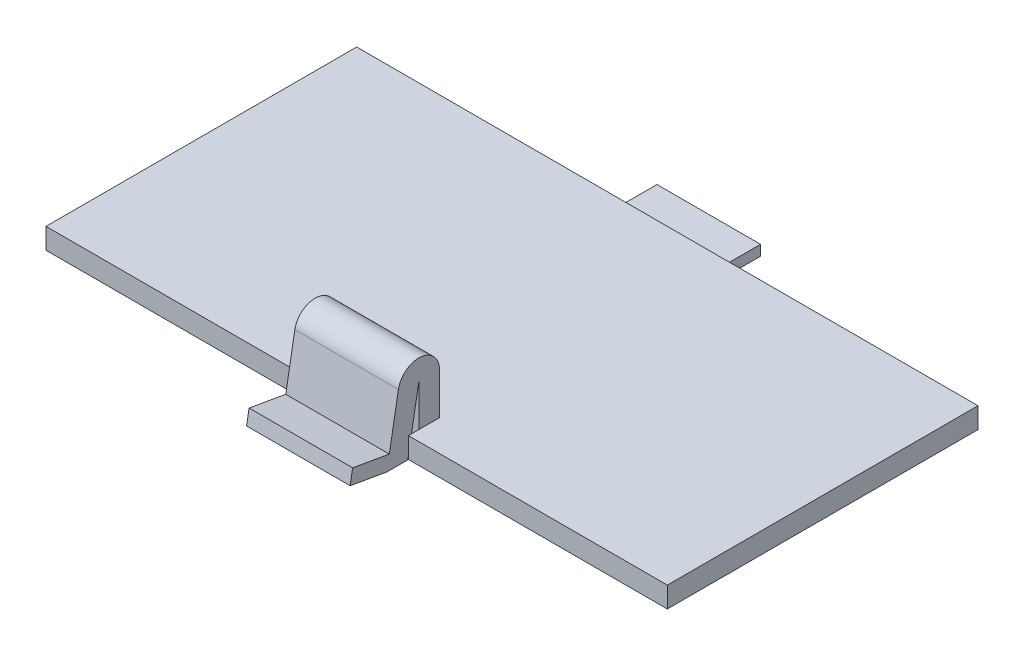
ISO-10303-21;
HEADER;
FILE_DESCRIPTION(('STEP AP214'),'2;1');
FILE_NAME('part.step','',(''),(''),'','','');
FILE_SCHEMA(('AUTOMOTIVE_DESIGN { 1 0 10303 214 1 1 1 1 }'));
ENDSEC;
DATA;
#1=APPLICATION_CONTEXT('core data for automotive mechanical design processes');
#2=APPLICATION_PROTOCOL_DEFINITION('international standard','automotive_design',2000,#1);
#3=PRODUCT_CONTEXT('',#1,'mechanical');
#4=PRODUCT('Part','Part','',(#3));
#5=PRODUCT_RELATED_PRODUCT_CATEGORY('part','',(#4));
#6=PRODUCT_DEFINITION_FORMATION('','',#4);
#7=PRODUCT_DEFINITION_CONTEXT('part definition',#1,'design');
#8=PRODUCT_DEFINITION('design','',#6,#7);
#9=PRODUCT_DEFINITION_SHAPE('','',#8);
#10=(LENGTH_UNIT() NAMED_UNIT(*) SI_UNIT(.MILLI.,.METRE.));
#11=(NAMED_UNIT(*) PLANE_ANGLE_UNIT() SI_UNIT($,.RADIAN.));
#12=(NAMED_UNIT(*) SI_UNIT($,.STERADIAN.) SOLID_ANGLE_UNIT());
#13=UNCERTAINTY_MEASURE_WITH_UNIT(LENGTH_MEASURE(1.E-05),#10,'distance_accuracy_value','');
#14=(GEOMETRIC_REPRESENTATION_CONTEXT(3) GLOBAL_UNCERTAINTY_ASSIGNED_CONTEXT((#13)) GLOBAL_UNIT_ASSIGNED_CONTEXT((#10,
#11,#12)) REPRESENTATION_CONTEXT('',''));
#15=CARTESIAN_POINT('',(0.,0.,0.));
#16=DIRECTION('',(0.,0.,1.));
#17=DIRECTION('',(1.,0.,0.));
#18=AXIS2_PLACEMENT_3D('',#15,#16,#17);
#19=CARTESIAN_POINT('',(-125.255102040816,-1.,63.7857142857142));
#20=DIRECTION('',(-1.,0.,0.));
#21=DIRECTION('',(0.,0.,1.));
#22=AXIS2_PLACEMENT_3D('',#19,#20,#21);
#23=PLANE('',#22);
#24=DIRECTION('',(0.,0.984807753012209,-0.173648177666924));
#25=VECTOR('',#24,1.);
#26=CARTESIAN_POINT('',(-125.255102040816,-0.939231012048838,64.4803069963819));
#27=LINE('',#26,#25);
#28=CARTESIAN_POINT('',(-125.255102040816,0.164359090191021,64.2857142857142));
#29=VERTEX_POINT('',#28);
#30=CARTESIAN_POINT('',(-125.255102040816,1.,64.1383682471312));
#31=VERTEX_POINT('',#30);
#32=EDGE_CURVE('E241',#29,#31,#27,.T.);
#33=ORIENTED_EDGE('',*,*,#32,.F.);
#34=DIRECTION('',(0.,1.,0.));
#35=VECTOR('',#34,1.);
#36=CARTESIAN_POINT('',(-125.255102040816,-1.,64.2857142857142));
#37=LINE('',#36,#35);
#38=CARTESIAN_POINT('',(-125.255102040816,0.,64.2857142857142));
#39=VERTEX_POINT('',#38);
#40=EDGE_CURVE('E249',#39,#29,#37,.T.);
#41=ORIENTED_EDGE('',*,*,#40,.F.);
#42=DIRECTION('',(0.,0.,1.));
#43=VECTOR('',#42,1.);
#44=CARTESIAN_POINT('',(-125.255102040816,0.,0.));
#45=LINE('',#44,#43);
#46=CARTESIAN_POINT('',(-125.255102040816,0.,63.7857142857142));
#47=VERTEX_POINT('',#46);
#48=EDGE_CURVE('E361',#47,#39,#45,.T.);
#49=ORIENTED_EDGE('',*,*,#48,.F.);
#50=DIRECTION('',(0.,1.,0.));
#51=VECTOR('',#50,1.);
#52=CARTESIAN_POINT('',(-125.255102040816,-1.,63.7857142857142));
#53=LINE('',#52,#51);
#54=CARTESIAN_POINT('',(-125.255102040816,1.,63.7857142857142));
#55=VERTEX_POINT('',#54);
#56=EDGE_CURVE('E254',#47,#55,#53,.T.);
#57=ORIENTED_EDGE('',*,*,#56,.T.);
#58=DIRECTION('',(0.,0.,1.));
#59=VECTOR('',#58,1.);
#60=CARTESIAN_POINT('',(-125.255102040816,1.,63.7857142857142));
#61=LINE('',#60,#59);
#62=EDGE_CURVE('E246',#55,#31,#61,.T.);
#63=ORIENTED_EDGE('',*,*,#62,.T.);
#64=EDGE_LOOP('',(#33,#41,#49,#57,#63));
#65=FACE_BOUND('',#64,.T.);
#66=ADVANCED_FACE('F35',(#65),#23,.F.);
#67=CARTESIAN_POINT('',(-120.255102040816,-1.,63.7857142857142));
#68=DIRECTION('',(-1.,0.,0.));
#69=DIRECTION('',(0.,0.,1.));
#70=AXIS2_PLACEMENT_3D('',#67,#68,#69);
#71=PLANE('',#70);
#72=DIRECTION('',(0.,1.,0.));
#73=VECTOR('',#72,1.);
#74=CARTESIAN_POINT('',(-120.255102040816,-1.,64.2857142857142));
#75=LINE('',#74,#73);
#76=CARTESIAN_POINT('',(-120.255102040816,0.,64.2857142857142));
#77=VERTEX_POINT('',#76);
#78=CARTESIAN_POINT('',(-120.255102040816,0.164359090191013,64.2857142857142));
#79=VERTEX_POINT('',#78);
#80=EDGE_CURVE('E259',#77,#79,#75,.T.);
#81=ORIENTED_EDGE('',*,*,#80,.T.);
#82=DIRECTION('',(0.,0.984807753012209,-0.173648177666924));
#83=VECTOR('',#82,1.);
#84=CARTESIAN_POINT('',(-120.255102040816,-0.879385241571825,64.4697545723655));
#85=LINE('',#84,#83);
#86=CARTESIAN_POINT('',(-120.255102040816,1.,64.1383682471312));
#87=VERTEX_POINT('',#86);
#88=EDGE_CURVE('E43',#79,#87,#85,.T.);
#89=ORIENTED_EDGE('',*,*,#88,.T.);
#90=DIRECTION('',(0.,0.,1.));
#91=VECTOR('',#90,1.);
#92=CARTESIAN_POINT('',(-120.255102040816,1.,63.7857142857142));
#93=LINE('',#92,#91);
#94=CARTESIAN_POINT('',(-120.255102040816,1.,63.7857142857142));
#95=VERTEX_POINT('',#94);
#96=EDGE_CURVE('E242',#95,#87,#93,.T.);
#97=ORIENTED_EDGE('',*,*,#96,.F.);
#98=DIRECTION('',(0.,1.,0.));
#99=VECTOR('',#98,1.);
#100=CARTESIAN_POINT('',(-120.255102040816,-1.,63.7857142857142));
#101=LINE('',#100,#99);
#102=CARTESIAN_POINT('',(-120.255102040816,0.,63.7857142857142));
#103=VERTEX_POINT('',#102);
#104=EDGE_CURVE('E256',#103,#95,#101,.T.);
#105=ORIENTED_EDGE('',*,*,#104,.F.);
#106=DIRECTION('',(0.,0.,1.));
#107=VECTOR('',#106,1.);
#108=CARTESIAN_POINT('',(-120.255102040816,0.,0.));
#109=LINE('',#108,#107);
#110=EDGE_CURVE('E357',#103,#77,#109,.T.);
#111=ORIENTED_EDGE('',*,*,#110,.T.);
#112=EDGE_LOOP('',(#81,#89,#97,#105,#111));
#113=FACE_BOUND('',#112,.T.);
#114=ADVANCED_FACE('F366',(#113),#71,.T.);
#115=CARTESIAN_POINT('',(-137.755102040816,1.,64.2857142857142));
#116=DIRECTION('',(0.,0.,-1.));
#117=DIRECTION('',(-1.,0.,0.));
#118=AXIS2_PLACEMENT_3D('',#115,#116,#117);
#119=PLANE('',#118);
#120=ORIENTED_EDGE('',*,*,#80,.F.);
#121=DIRECTION('',(1.,0.,0.));
#122=VECTOR('',#121,1.);
#123=CARTESIAN_POINT('',(-137.755102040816,0.,64.2857142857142));
#124=LINE('',#123,#122);
#125=CARTESIAN_POINT('',(-107.755102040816,0.,64.2857142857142));
#126=VERTEX_POINT('',#125);
#127=EDGE_CURVE('E338',#77,#126,#124,.T.);
#128=ORIENTED_EDGE('',*,*,#127,.T.);
#129=DIRECTION('',(0.,-1.,0.));
#130=VECTOR('',#129,1.);
#131=CARTESIAN_POINT('',(-107.755102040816,1.,64.2857142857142));
#132=LINE('',#131,#130);
#133=CARTESIAN_POINT('',(-107.755102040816,1.,64.2857142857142));
#134=VERTEX_POINT('',#133);
#135=EDGE_CURVE('E351',#134,#126,#132,.T.);
#136=ORIENTED_EDGE('',*,*,#135,.F.);
#137=DIRECTION('',(1.,0.,0.));
#138=VECTOR('',#137,1.);
#139=CARTESIAN_POINT('',(-137.755102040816,1.,64.2857142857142));
#140=LINE('',#139,#138);
#141=CARTESIAN_POINT('',(-120.255102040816,1.,64.2857142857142));
#142=VERTEX_POINT('',#141);
#143=EDGE_CURVE('E326',#142,#134,#140,.T.);
#144=ORIENTED_EDGE('',*,*,#143,.F.);
#145=EDGE_CURVE('E248',#79,#142,#75,.T.);
#146=ORIENTED_EDGE('',*,*,#145,.F.);
#147=EDGE_LOOP('',(#120,#128,#136,#144,#146));
#148=FACE_BOUND('',#147,.T.);
#149=ADVANCED_FACE('F396',(#148),#119,.F.);
#150=CARTESIAN_POINT('',(0.,1.,0.));
#151=DIRECTION('',(0.,1.,0.));
#152=DIRECTION('',(0.,0.,1.));
#153=AXIS2_PLACEMENT_3D('',#150,#151,#152);
#154=PLANE('',#153);
#155=ORIENTED_EDGE('',*,*,#62,.F.);
#156=DIRECTION('',(0.,0.,1.));
#157=VECTOR('',#156,1.);
#158=CARTESIAN_POINT('',(-125.255102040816,1.,62.7857142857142));
#159=LINE('',#158,#157);
#160=CARTESIAN_POINT('',(-125.255102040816,1.,62.7857142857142));
#161=VERTEX_POINT('',#160);
#162=EDGE_CURVE('E275',#161,#55,#159,.T.);
#163=ORIENTED_EDGE('',*,*,#162,.F.);
#164=DIRECTION('',(-1.,0.,0.));
#165=VECTOR('',#164,1.);
#166=CARTESIAN_POINT('',(-125.255102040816,1.,62.7857142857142));
#167=LINE('',#166,#165);
#168=CARTESIAN_POINT('',(-120.255102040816,1.,62.7857142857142));
#169=VERTEX_POINT('',#168);
#170=EDGE_CURVE('E281',#169,#161,#167,.T.);
#171=ORIENTED_EDGE('',*,*,#170,.F.);
#172=DIRECTION('',(0.,0.,-1.));
#173=VECTOR('',#172,1.);
#174=CARTESIAN_POINT('',(-120.255102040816,1.,62.7857142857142));
#175=LINE('',#174,#173);
#176=EDGE_CURVE('E270',#95,#169,#175,.T.);
#177=ORIENTED_EDGE('',*,*,#176,.F.);
#178=ORIENTED_EDGE('',*,*,#96,.T.);
#179=EDGE_CURVE('E240',#87,#142,#93,.T.);
#180=ORIENTED_EDGE('',*,*,#179,.T.);
#181=ORIENTED_EDGE('',*,*,#143,.T.);
#182=DIRECTION('',(0.,0.,-1.));
#183=VECTOR('',#182,1.);
#184=CARTESIAN_POINT('',(-107.755102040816,1.,49.2857142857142));
#185=LINE('',#184,#183);
#186=CARTESIAN_POINT('',(-107.755102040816,1.,49.2857142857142));
#187=VERTEX_POINT('',#186);
#188=EDGE_CURVE('E331',#134,#187,#185,.T.);
#189=ORIENTED_EDGE('',*,*,#188,.T.);
#190=DIRECTION('',(-1.,0.,0.));
#191=VECTOR('',#190,1.);
#192=CARTESIAN_POINT('',(-137.755102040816,1.,49.2857142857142));
#193=LINE('',#192,#191);
#194=CARTESIAN_POINT('',(-137.755102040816,1.,49.2857142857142));
#195=VERTEX_POINT('',#194);
#196=EDGE_CURVE('E333',#187,#195,#193,.T.);
#197=ORIENTED_EDGE('',*,*,#196,.T.);
#198=DIRECTION('',(0.,0.,1.));
#199=VECTOR('',#198,1.);
#200=CARTESIAN_POINT('',(-137.755102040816,1.,49.2857142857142));
#201=LINE('',#200,#199);
#202=CARTESIAN_POINT('',(-137.755102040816,1.,64.2857142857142));
#203=VERTEX_POINT('',#202);
#204=EDGE_CURVE('E323',#195,#203,#201,.T.);
#205=ORIENTED_EDGE('',*,*,#204,.T.);
#206=CARTESIAN_POINT('',(-125.255102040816,1.,64.2857142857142));
#207=VERTEX_POINT('',#206);
#208=EDGE_CURVE('E328',#203,#207,#140,.T.);
#209=ORIENTED_EDGE('',*,*,#208,.T.);
#210=EDGE_CURVE('E245',#31,#207,#61,.T.);
#211=ORIENTED_EDGE('',*,*,#210,.F.);
#212=EDGE_LOOP('',(#155,#163,#171,#177,#178,#180,#181,#189,#197,#205,#209,#211));
#213=FACE_BOUND('',#212,.T.);
#214=ADVANCED_FACE('F376',(#213),#154,.T.);
#215=CARTESIAN_POINT('',(-137.755102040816,1.,49.2857142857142));
#216=DIRECTION('',(0.,0.,1.));
#217=DIRECTION('',(1.,0.,0.));
#218=AXIS2_PLACEMENT_3D('',#215,#216,#217);
#219=PLANE('',#218);
#220=DIRECTION('',(0.,-1.,0.));
#221=VECTOR('',#220,1.);
#222=CARTESIAN_POINT('',(-120.255102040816,0.5,49.2857142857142));
#223=LINE('',#222,#221);
#224=CARTESIAN_POINT('',(-120.255102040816,0.5,49.2857142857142));
#225=VERTEX_POINT('',#224);
#226=CARTESIAN_POINT('',(-120.255102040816,0.,49.2857142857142));
#227=VERTEX_POINT('',#226);
#228=EDGE_CURVE('E299',#225,#227,#223,.T.);
#229=ORIENTED_EDGE('',*,*,#228,.F.);
#230=DIRECTION('',(-1.,0.,0.));
#231=VECTOR('',#230,1.);
#232=CARTESIAN_POINT('',(-120.255102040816,0.5,49.2857142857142));
#233=LINE('',#232,#231);
#234=CARTESIAN_POINT('',(-125.255102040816,0.5,49.2857142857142));
#235=VERTEX_POINT('',#234);
#236=EDGE_CURVE('E310',#225,#235,#233,.T.);
#237=ORIENTED_EDGE('',*,*,#236,.T.);
#238=DIRECTION('',(0.,-1.,0.));
#239=VECTOR('',#238,1.);
#240=CARTESIAN_POINT('',(-125.255102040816,0.5,49.2857142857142));
#241=LINE('',#240,#239);
#242=CARTESIAN_POINT('',(-125.255102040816,0.,49.2857142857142));
#243=VERTEX_POINT('',#242);
#244=EDGE_CURVE('E295',#235,#243,#241,.T.);
#245=ORIENTED_EDGE('',*,*,#244,.T.);
#246=DIRECTION('',(-1.,0.,0.));
#247=VECTOR('',#246,1.);
#248=CARTESIAN_POINT('',(-137.755102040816,0.,49.2857142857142));
#249=LINE('',#248,#247);
#250=CARTESIAN_POINT('',(-137.755102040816,0.,49.2857142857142));
#251=VERTEX_POINT('',#250);
#252=EDGE_CURVE('E343',#243,#251,#249,.T.);
#253=ORIENTED_EDGE('',*,*,#252,.T.);
#254=DIRECTION('',(0.,-1.,0.));
#255=VECTOR('',#254,1.);
#256=CARTESIAN_POINT('',(-137.755102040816,1.,49.2857142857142));
#257=LINE('',#256,#255);
#258=EDGE_CURVE('E335',#195,#251,#257,.T.);
#259=ORIENTED_EDGE('',*,*,#258,.F.);
#260=ORIENTED_EDGE('',*,*,#196,.F.);
#261=DIRECTION('',(0.,-1.,0.));
#262=VECTOR('',#261,1.);
#263=CARTESIAN_POINT('',(-107.755102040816,1.,49.2857142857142));
#264=LINE('',#263,#262);
#265=CARTESIAN_POINT('',(-107.755102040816,0.,49.2857142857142));
#266=VERTEX_POINT('',#265);
#267=EDGE_CURVE('E348',#187,#266,#264,.T.);
#268=ORIENTED_EDGE('',*,*,#267,.T.);
#269=EDGE_CURVE('E327',#266,#227,#249,.T.);
#270=ORIENTED_EDGE('',*,*,#269,.T.);
#271=EDGE_LOOP('',(#229,#237,#245,#253,#259,#260,#268,#270));
#272=FACE_BOUND('',#271,.T.);
#273=ADVANCED_FACE('F473',(#272),#219,.F.);
#274=CARTESIAN_POINT('',(-137.755102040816,1.,49.2857142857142));
#275=DIRECTION('',(1.,0.,0.));
#276=DIRECTION('',(0.,0.,-1.));
#277=AXIS2_PLACEMENT_3D('',#274,#275,#276);
#278=PLANE('',#277);
#279=DIRECTION('',(0.,0.,1.));
#280=VECTOR('',#279,1.);
#281=CARTESIAN_POINT('',(-137.755102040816,0.,49.2857142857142));
#282=LINE('',#281,#280);
#283=CARTESIAN_POINT('',(-137.755102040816,0.,64.2857142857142));
#284=VERTEX_POINT('',#283);
#285=EDGE_CURVE('E322',#251,#284,#282,.T.);
#286=ORIENTED_EDGE('',*,*,#285,.T.);
#287=DIRECTION('',(0.,-1.,0.));
#288=VECTOR('',#287,1.);
#289=CARTESIAN_POINT('',(-137.755102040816,1.,64.2857142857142));
#290=LINE('',#289,#288);
#291=EDGE_CURVE('E354',#203,#284,#290,.T.);
#292=ORIENTED_EDGE('',*,*,#291,.F.);
#293=ORIENTED_EDGE('',*,*,#204,.F.);
#294=ORIENTED_EDGE('',*,*,#258,.T.);
#295=EDGE_LOOP('',(#286,#292,#293,#294));
#296=FACE_BOUND('',#295,.T.);
#297=ADVANCED_FACE('F37',(#296),#278,.F.);
#298=EDGE_CURVE('E339',#284,#39,#124,.T.);
#299=ORIENTED_EDGE('',*,*,#298,.T.);
#300=ORIENTED_EDGE('',*,*,#40,.T.);
#301=EDGE_CURVE('E253',#29,#207,#37,.T.);
#302=ORIENTED_EDGE('',*,*,#301,.T.);
#303=ORIENTED_EDGE('',*,*,#208,.F.);
#304=ORIENTED_EDGE('',*,*,#291,.T.);
#305=EDGE_LOOP('',(#299,#300,#302,#303,#304));
#306=FACE_BOUND('',#305,.T.);
#307=ADVANCED_FACE('F415',(#306),#119,.F.);
#308=CARTESIAN_POINT('',(-107.755102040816,1.,49.2857142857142));
#309=DIRECTION('',(-1.,0.,0.));
#310=DIRECTION('',(0.,0.,1.));
#311=AXIS2_PLACEMENT_3D('',#308,#309,#310);
#312=PLANE('',#311);
#313=DIRECTION('',(0.,0.,-1.));
#314=VECTOR('',#313,1.);
#315=CARTESIAN_POINT('',(-107.755102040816,0.,49.2857142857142));
#316=LINE('',#315,#314);
#317=EDGE_CURVE('E341',#126,#266,#316,.T.);
#318=ORIENTED_EDGE('',*,*,#317,.T.);
#319=ORIENTED_EDGE('',*,*,#267,.F.);
#320=ORIENTED_EDGE('',*,*,#188,.F.);
#321=ORIENTED_EDGE('',*,*,#135,.T.);
#322=EDGE_LOOP('',(#318,#319,#320,#321));
#323=FACE_BOUND('',#322,.T.);
#324=ADVANCED_FACE('F399',(#323),#312,.F.);
#325=CARTESIAN_POINT('',(0.,0.,0.));
#326=DIRECTION('',(0.,1.,0.));
#327=DIRECTION('',(0.,0.,1.));
#328=AXIS2_PLACEMENT_3D('',#325,#326,#327);
#329=PLANE('',#328);
#330=ORIENTED_EDGE('',*,*,#110,.F.);
#331=DIRECTION('',(1.,0.,0.));
#332=VECTOR('',#331,1.);
#333=CARTESIAN_POINT('',(0.,0.,63.7857142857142));
#334=LINE('',#333,#332);
#335=EDGE_CURVE('E359',#47,#103,#334,.T.);
#336=ORIENTED_EDGE('',*,*,#335,.F.);
#337=ORIENTED_EDGE('',*,*,#48,.T.);
#338=ORIENTED_EDGE('',*,*,#298,.F.);
#339=ORIENTED_EDGE('',*,*,#285,.F.);
#340=ORIENTED_EDGE('',*,*,#252,.F.);
#341=DIRECTION('',(0.,0.,1.));
#342=VECTOR('',#341,1.);
#343=CARTESIAN_POINT('',(-125.255102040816,0.,47.2857142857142));
#344=LINE('',#343,#342);
#345=CARTESIAN_POINT('',(-125.255102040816,0.,47.2857142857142));
#346=VERTEX_POINT('',#345);
#347=EDGE_CURVE('E320',#346,#243,#344,.T.);
#348=ORIENTED_EDGE('',*,*,#347,.F.);
#349=DIRECTION('',(-1.,0.,0.));
#350=VECTOR('',#349,1.);
#351=CARTESIAN_POINT('',(-120.255102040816,0.,47.2857142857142));
#352=LINE('',#351,#350);
#353=CARTESIAN_POINT('',(-120.255102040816,0.,47.2857142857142));
#354=VERTEX_POINT('',#353);
#355=EDGE_CURVE('E296',#354,#346,#352,.T.);
#356=ORIENTED_EDGE('',*,*,#355,.F.);
#357=DIRECTION('',(0.,0.,1.));
#358=VECTOR('',#357,1.);
#359=CARTESIAN_POINT('',(-120.255102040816,0.,47.2857142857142));
#360=LINE('',#359,#358);
#361=EDGE_CURVE('E307',#354,#227,#360,.T.);
#362=ORIENTED_EDGE('',*,*,#361,.T.);
#363=ORIENTED_EDGE('',*,*,#269,.F.);
#364=ORIENTED_EDGE('',*,*,#317,.F.);
#365=ORIENTED_EDGE('',*,*,#127,.F.);
#366=EDGE_LOOP('',(#330,#336,#337,#338,#339,#340,#348,#356,#362,#363,#364,#365));
#367=FACE_BOUND('',#366,.T.);
#368=ADVANCED_FACE('F391',(#367),#329,.F.);
#369=CARTESIAN_POINT('',(-125.255102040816,0.5,47.2857142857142));
#370=DIRECTION('',(-1.,0.,0.));
#371=DIRECTION('',(0.,0.,1.));
#372=AXIS2_PLACEMENT_3D('',#369,#370,#371);
#373=PLANE('',#372);
#374=ORIENTED_EDGE('',*,*,#244,.F.);
#375=DIRECTION('',(0.,0.,1.));
#376=VECTOR('',#375,1.);
#377=CARTESIAN_POINT('',(-125.255102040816,0.5,47.2857142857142));
#378=LINE('',#377,#376);
#379=CARTESIAN_POINT('',(-125.255102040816,0.5,47.2857142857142));
#380=VERTEX_POINT('',#379);
#381=EDGE_CURVE('E318',#380,#235,#378,.T.);
#382=ORIENTED_EDGE('',*,*,#381,.F.);
#383=DIRECTION('',(0.,-1.,0.));
#384=VECTOR('',#383,1.);
#385=CARTESIAN_POINT('',(-125.255102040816,0.5,47.2857142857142));
#386=LINE('',#385,#384);
#387=EDGE_CURVE('E298',#380,#346,#386,.T.);
#388=ORIENTED_EDGE('',*,*,#387,.T.);
#389=ORIENTED_EDGE('',*,*,#347,.T.);
#390=EDGE_LOOP('',(#374,#382,#388,#389));
#391=FACE_BOUND('',#390,.T.);
#392=ADVANCED_FACE('F466',(#391),#373,.T.);
#393=CARTESIAN_POINT('',(-120.255102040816,0.5,47.2857142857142));
#394=DIRECTION('',(0.,1.,0.));
#395=DIRECTION('',(0.,0.,1.));
#396=AXIS2_PLACEMENT_3D('',#393,#394,#395);
#397=PLANE('',#396);
#398=ORIENTED_EDGE('',*,*,#236,.F.);
#399=DIRECTION('',(0.,0.,1.));
#400=VECTOR('',#399,1.);
#401=CARTESIAN_POINT('',(-120.255102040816,0.5,47.2857142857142));
#402=LINE('',#401,#400);
#403=CARTESIAN_POINT('',(-120.255102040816,0.5,47.2857142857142));
#404=VERTEX_POINT('',#403);
#405=EDGE_CURVE('E316',#404,#225,#402,.T.);
#406=ORIENTED_EDGE('',*,*,#405,.F.);
#407=DIRECTION('',(-1.,0.,0.));
#408=VECTOR('',#407,1.);
#409=CARTESIAN_POINT('',(-120.255102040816,0.5,47.2857142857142));
#410=LINE('',#409,#408);
#411=EDGE_CURVE('E302',#404,#380,#410,.T.);
#412=ORIENTED_EDGE('',*,*,#411,.T.);
#413=ORIENTED_EDGE('',*,*,#381,.T.);
#414=EDGE_LOOP('',(#398,#406,#412,#413));
#415=FACE_BOUND('',#414,.T.);
#416=ADVANCED_FACE('F462',(#415),#397,.T.);
#417=CARTESIAN_POINT('',(-120.255102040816,0.5,47.2857142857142));
#418=DIRECTION('',(-1.,0.,0.));
#419=DIRECTION('',(0.,0.,1.));
#420=AXIS2_PLACEMENT_3D('',#417,#418,#419);
#421=PLANE('',#420);
#422=ORIENTED_EDGE('',*,*,#228,.T.);
#423=ORIENTED_EDGE('',*,*,#361,.F.);
#424=DIRECTION('',(0.,-1.,0.));
#425=VECTOR('',#424,1.);
#426=CARTESIAN_POINT('',(-120.255102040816,0.5,47.2857142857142));
#427=LINE('',#426,#425);
#428=EDGE_CURVE('E305',#404,#354,#427,.T.);
#429=ORIENTED_EDGE('',*,*,#428,.F.);
#430=ORIENTED_EDGE('',*,*,#405,.T.);
#431=EDGE_LOOP('',(#422,#423,#429,#430));
#432=FACE_BOUND('',#431,.T.);
#433=ADVANCED_FACE('F458',(#432),#421,.F.);
#434=CARTESIAN_POINT('',(0.,0.,47.2857142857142));
#435=DIRECTION('',(0.,0.,1.));
#436=DIRECTION('',(1.,0.,0.));
#437=AXIS2_PLACEMENT_3D('',#434,#435,#436);
#438=PLANE('',#437);
#439=ORIENTED_EDGE('',*,*,#355,.T.);
#440=ORIENTED_EDGE('',*,*,#387,.F.);
#441=ORIENTED_EDGE('',*,*,#411,.F.);
#442=ORIENTED_EDGE('',*,*,#428,.T.);
#443=EDGE_LOOP('',(#439,#440,#441,#442));
#444=FACE_BOUND('',#443,.T.);
#445=ADVANCED_FACE('F455',(#444),#438,.F.);
#446=CARTESIAN_POINT('',(-120.255102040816,3.,62.7857142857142));
#447=DIRECTION('',(-1.,0.,0.));
#448=DIRECTION('',(0.,0.,1.));
#449=AXIS2_PLACEMENT_3D('',#446,#447,#448);
#450=PLANE('',#449);
#451=DIRECTION('',(0.,0.984807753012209,-0.173648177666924));
#452=VECTOR('',#451,1.);
#453=CARTESIAN_POINT('',(-120.255102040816,-0.765582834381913,65.4651147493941));
#454=LINE('',#453,#452);
#455=CARTESIAN_POINT('',(-120.255102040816,0.689365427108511,65.2085681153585));
#456=VERTEX_POINT('',#455);
#457=CARTESIAN_POINT('',(-120.255102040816,3.17364817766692,64.7705220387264));
#458=VERTEX_POINT('',#457);
#459=EDGE_CURVE('E206',#456,#458,#454,.T.);
#460=ORIENTED_EDGE('',*,*,#459,.F.);
#461=DIRECTION('',(0.,-0.173648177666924,-0.984807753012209));
#462=VECTOR('',#461,1.);
#463=CARTESIAN_POINT('',(-120.255102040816,1.00193214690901,66.9812220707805));
#464=LINE('',#463,#462);
#465=CARTESIAN_POINT('',(-120.255102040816,1.00193214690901,66.9812220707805));
#466=VERTEX_POINT('',#465);
#467=EDGE_CURVE('E203',#466,#456,#464,.T.);
#468=ORIENTED_EDGE('',*,*,#467,.F.);
#469=DIRECTION('',(0.,0.984807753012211,-0.173648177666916));
#470=VECTOR('',#469,1.);
#471=CARTESIAN_POINT('',(-120.255102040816,0.312566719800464,67.1027757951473));
#472=LINE('',#471,#470);
#473=CARTESIAN_POINT('',(-120.255102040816,0.312566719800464,67.1027757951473));
#474=VERTEX_POINT('',#473);
#475=EDGE_CURVE('E189',#474,#466,#472,.T.);
#476=ORIENTED_EDGE('',*,*,#475,.F.);
#477=DIRECTION('',(0.,-0.173648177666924,-0.984807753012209));
#478=VECTOR('',#477,1.);
#479=CARTESIAN_POINT('',(-120.255102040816,0.312566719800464,67.1027757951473));
#480=LINE('',#479,#478);
#481=CARTESIAN_POINT('',(-120.255102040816,0.,65.3301218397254));
#482=VERTEX_POINT('',#481);
#483=EDGE_CURVE('E208',#474,#482,#480,.T.);
#484=ORIENTED_EDGE('',*,*,#483,.T.);
#485=DIRECTION('',(0.,0.,-1.));
#486=VECTOR('',#485,1.);
#487=CARTESIAN_POINT('',(-120.255102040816,0.,97.2857142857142));
#488=LINE('',#487,#486);
#489=CARTESIAN_POINT('',(-120.255102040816,0.,64.3146952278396));
#490=VERTEX_POINT('',#489);
#491=EDGE_CURVE('E219',#482,#490,#488,.T.);
#492=ORIENTED_EDGE('',*,*,#491,.T.);
#493=DIRECTION('',(0.,0.984807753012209,-0.173648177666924));
#494=VECTOR('',#493,1.);
#495=CARTESIAN_POINT('',(-120.255102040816,-0.939231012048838,64.4803069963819));
#496=LINE('',#495,#494);
#497=EDGE_CURVE('E235',#490,#79,#496,.T.);
#498=ORIENTED_EDGE('',*,*,#497,.T.);
#499=ORIENTED_EDGE('',*,*,#145,.T.);
#500=ORIENTED_EDGE('',*,*,#179,.F.);
#501=CARTESIAN_POINT('',(-120.255102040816,3.,63.7857142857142));
#502=VERTEX_POINT('',#501);
#503=EDGE_CURVE('E234',#87,#502,#496,.T.);
#504=ORIENTED_EDGE('',*,*,#503,.T.);
#505=DIRECTION('',(0.,-1.,0.));
#506=VECTOR('',#505,1.);
#507=CARTESIAN_POINT('',(-120.255102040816,3.,63.7857142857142));
#508=LINE('',#507,#506);
#509=EDGE_CURVE('E278',#502,#95,#508,.T.);
#510=ORIENTED_EDGE('',*,*,#509,.T.);
#511=ORIENTED_EDGE('',*,*,#176,.T.);
#512=DIRECTION('',(0.,-1.,0.));
#513=VECTOR('',#512,1.);
#514=CARTESIAN_POINT('',(-120.255102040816,3.,62.7857142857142));
#515=LINE('',#514,#513);
#516=CARTESIAN_POINT('',(-120.255102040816,3.,62.7857142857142));
#517=VERTEX_POINT('',#516);
#518=EDGE_CURVE('E293',#517,#169,#515,.T.);
#519=ORIENTED_EDGE('',*,*,#518,.F.);
#520=CARTESIAN_POINT('',(-120.255102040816,3.,63.7857142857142));
#521=DIRECTION('',(-1.,0.,0.));
#522=DIRECTION('',(0.,0.,1.));
#523=AXIS2_PLACEMENT_3D('',#520,#521,#522);
#524=CIRCLE('',#523,0.999999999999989);
#525=EDGE_CURVE('E264',#458,#517,#524,.T.);
#526=ORIENTED_EDGE('',*,*,#525,.F.);
#527=EDGE_LOOP('',(#460,#468,#476,#484,#492,#498,#499,#500,#504,#510,#511,#519,#526));
#528=FACE_BOUND('',#527,.T.);
#529=ADVANCED_FACE('F204',(#528),#450,.F.);
#530=CARTESIAN_POINT('',(-125.255102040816,3.,62.7857142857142));
#531=DIRECTION('',(0.,0.,1.));
#532=DIRECTION('',(1.,0.,0.));
#533=AXIS2_PLACEMENT_3D('',#530,#531,#532);
#534=PLANE('',#533);
#535=ORIENTED_EDGE('',*,*,#170,.T.);
#536=DIRECTION('',(0.,-1.,0.));
#537=VECTOR('',#536,1.);
#538=CARTESIAN_POINT('',(-125.255102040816,3.,62.7857142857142));
#539=LINE('',#538,#537);
#540=CARTESIAN_POINT('',(-125.255102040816,3.,62.7857142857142));
#541=VERTEX_POINT('',#540);
#542=EDGE_CURVE('E290',#541,#161,#539,.T.);
#543=ORIENTED_EDGE('',*,*,#542,.F.);
#544=DIRECTION('',(-1.,0.,0.));
#545=VECTOR('',#544,1.);
#546=CARTESIAN_POINT('',(-125.255102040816,3.,62.7857142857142));
#547=LINE('',#546,#545);
#548=EDGE_CURVE('E271',#517,#541,#547,.T.);
#549=ORIENTED_EDGE('',*,*,#548,.F.);
#550=ORIENTED_EDGE('',*,*,#518,.T.);
#551=EDGE_LOOP('',(#535,#543,#549,#550));
#552=FACE_BOUND('',#551,.T.);
#553=ADVANCED_FACE('F425',(#552),#534,.F.);
#554=CARTESIAN_POINT('',(-125.255102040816,3.,62.7857142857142));
#555=DIRECTION('',(1.,0.,0.));
#556=DIRECTION('',(0.,0.,-1.));
#557=AXIS2_PLACEMENT_3D('',#554,#555,#556);
#558=PLANE('',#557);
#559=CARTESIAN_POINT('',(-125.255102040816,0.,64.3146952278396));
#560=VERTEX_POINT('',#559);
#561=EDGE_CURVE('E238',#560,#29,#27,.T.);
#562=ORIENTED_EDGE('',*,*,#561,.F.);
#563=DIRECTION('',(0.,0.,1.));
#564=VECTOR('',#563,1.);
#565=CARTESIAN_POINT('',(-125.255102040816,0.,62.7857142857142));
#566=LINE('',#565,#564);
#567=CARTESIAN_POINT('',(-125.255102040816,0.,65.3301218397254));
#568=VERTEX_POINT('',#567);
#569=EDGE_CURVE('E226',#560,#568,#566,.T.);
#570=ORIENTED_EDGE('',*,*,#569,.T.);
#571=DIRECTION('',(0.,-0.173648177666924,-0.984807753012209));
#572=VECTOR('',#571,1.);
#573=CARTESIAN_POINT('',(-125.255102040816,0.312566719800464,67.1027757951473));
#574=LINE('',#573,#572);
#575=CARTESIAN_POINT('',(-125.255102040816,0.312566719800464,67.1027757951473));
#576=VERTEX_POINT('',#575);
#577=EDGE_CURVE('E220',#576,#568,#574,.T.);
#578=ORIENTED_EDGE('',*,*,#577,.F.);
#579=DIRECTION('',(0.,0.984807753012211,-0.173648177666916));
#580=VECTOR('',#579,1.);
#581=CARTESIAN_POINT('',(-125.255102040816,0.312566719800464,67.1027757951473));
#582=LINE('',#581,#580);
#583=CARTESIAN_POINT('',(-125.255102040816,1.00193214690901,66.9812220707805));
#584=VERTEX_POINT('',#583);
#585=EDGE_CURVE('E209',#576,#584,#582,.T.);
#586=ORIENTED_EDGE('',*,*,#585,.T.);
#587=DIRECTION('',(0.,-0.173648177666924,-0.984807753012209));
#588=VECTOR('',#587,1.);
#589=CARTESIAN_POINT('',(-125.255102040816,1.00193214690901,66.9812220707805));
#590=LINE('',#589,#588);
#591=CARTESIAN_POINT('',(-125.255102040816,0.689365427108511,65.2085681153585));
#592=VERTEX_POINT('',#591);
#593=EDGE_CURVE('E212',#584,#592,#590,.T.);
#594=ORIENTED_EDGE('',*,*,#593,.T.);
#595=DIRECTION('',(0.,0.984807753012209,-0.173648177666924));
#596=VECTOR('',#595,1.);
#597=CARTESIAN_POINT('',(-125.255102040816,-0.765582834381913,65.4651147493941));
#598=LINE('',#597,#596);
#599=CARTESIAN_POINT('',(-125.255102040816,3.17364817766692,64.7705220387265));
#600=VERTEX_POINT('',#599);
#601=EDGE_CURVE('E55',#592,#600,#598,.T.);
#602=ORIENTED_EDGE('',*,*,#601,.T.);
#603=CARTESIAN_POINT('',(-125.255102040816,3.,63.7857142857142));
#604=DIRECTION('',(-1.,0.,0.));
#605=DIRECTION('',(0.,0.,1.));
#606=AXIS2_PLACEMENT_3D('',#603,#604,#605);
#607=CIRCLE('',#606,0.999999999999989);
#608=EDGE_CURVE('E267',#600,#541,#607,.T.);
#609=ORIENTED_EDGE('',*,*,#608,.T.);
#610=ORIENTED_EDGE('',*,*,#542,.T.);
#611=ORIENTED_EDGE('',*,*,#162,.T.);
#612=DIRECTION('',(0.,-1.,0.));
#613=VECTOR('',#612,1.);
#614=CARTESIAN_POINT('',(-125.255102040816,3.,63.7857142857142));
#615=LINE('',#614,#613);
#616=CARTESIAN_POINT('',(-125.255102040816,3.,63.7857142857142));
#617=VERTEX_POINT('',#616);
#618=EDGE_CURVE('E287',#617,#55,#615,.T.);
#619=ORIENTED_EDGE('',*,*,#618,.F.);
#620=EDGE_CURVE('E237',#31,#617,#27,.T.);
#621=ORIENTED_EDGE('',*,*,#620,.F.);
#622=ORIENTED_EDGE('',*,*,#210,.T.);
#623=ORIENTED_EDGE('',*,*,#301,.F.);
#624=EDGE_LOOP('',(#562,#570,#578,#586,#594,#602,#609,#610,#611,#619,#621,#622,#623));
#625=FACE_BOUND('',#624,.T.);
#626=ADVANCED_FACE('F410',(#625),#558,.F.);
#627=CARTESIAN_POINT('',(-125.255102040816,3.,63.7857142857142));
#628=DIRECTION('',(0.,0.,-1.));
#629=DIRECTION('',(-1.,0.,0.));
#630=AXIS2_PLACEMENT_3D('',#627,#628,#629);
#631=PLANE('',#630);
#632=ORIENTED_EDGE('',*,*,#618,.T.);
#633=ORIENTED_EDGE('',*,*,#56,.F.);
#634=ORIENTED_EDGE('',*,*,#335,.T.);
#635=ORIENTED_EDGE('',*,*,#104,.T.);
#636=ORIENTED_EDGE('',*,*,#509,.F.);
#637=DIRECTION('',(1.,0.,0.));
#638=VECTOR('',#637,1.);
#639=CARTESIAN_POINT('',(-125.255102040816,3.,63.7857142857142));
#640=LINE('',#639,#638);
#641=EDGE_CURVE('E274',#617,#502,#640,.T.);
#642=ORIENTED_EDGE('',*,*,#641,.F.);
#643=EDGE_LOOP('',(#632,#633,#634,#635,#636,#642));
#644=FACE_BOUND('',#643,.T.);
#645=ADVANCED_FACE('F385',(#644),#631,.F.);
#646=CARTESIAN_POINT('',(-130.66128048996,3.,63.7857142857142));
#647=DIRECTION('',(-1.,0.,0.));
#648=DIRECTION('',(0.,0.,1.));
#649=AXIS2_PLACEMENT_3D('',#646,#647,#648);
#650=CYLINDRICAL_SURFACE('',#649,0.999999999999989);
#651=ORIENTED_EDGE('',*,*,#608,.F.);
#652=DIRECTION('',(1.,0.,0.));
#653=VECTOR('',#652,1.);
#654=CARTESIAN_POINT('',(-125.255102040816,3.17364817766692,64.7705220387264));
#655=LINE('',#654,#653);
#656=EDGE_CURVE('E252',#600,#458,#655,.T.);
#657=ORIENTED_EDGE('',*,*,#656,.T.);
#658=ORIENTED_EDGE('',*,*,#525,.T.);
#659=ORIENTED_EDGE('',*,*,#548,.T.);
#660=EDGE_LOOP('',(#651,#657,#658,#659));
#661=FACE_BOUND('',#660,.T.);
#662=ADVANCED_FACE('F427',(#661),#650,.T.);
#663=CARTESIAN_POINT('',(-125.255102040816,-0.939231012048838,64.4803069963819));
#664=DIRECTION('',(0.,0.173648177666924,0.984807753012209));
#665=DIRECTION('',(0.,-0.984807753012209,0.173648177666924));
#666=AXIS2_PLACEMENT_3D('',#663,#664,#665);
#667=PLANE('',#666);
#668=ORIENTED_EDGE('',*,*,#497,.F.);
#669=DIRECTION('',(-1.,0.,0.));
#670=VECTOR('',#669,1.);
#671=CARTESIAN_POINT('',(-125.255102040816,0.,64.3146952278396));
#672=LINE('',#671,#670);
#673=EDGE_CURVE('E229',#490,#560,#672,.T.);
#674=ORIENTED_EDGE('',*,*,#673,.T.);
#675=ORIENTED_EDGE('',*,*,#561,.T.);
#676=ORIENTED_EDGE('',*,*,#32,.T.);
#677=ORIENTED_EDGE('',*,*,#620,.T.);
#678=ORIENTED_EDGE('',*,*,#641,.T.);
#679=ORIENTED_EDGE('',*,*,#503,.F.);
#680=ORIENTED_EDGE('',*,*,#88,.F.);
#681=EDGE_LOOP('',(#668,#674,#675,#676,#677,#678,#679,#680));
#682=FACE_BOUND('',#681,.T.);
#683=ADVANCED_FACE('F403',(#682),#667,.F.);
#684=CARTESIAN_POINT('',(-125.255102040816,-0.765582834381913,65.4651147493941));
#685=DIRECTION('',(0.,-0.173648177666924,-0.984807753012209));
#686=DIRECTION('',(0.,0.984807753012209,-0.173648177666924));
#687=AXIS2_PLACEMENT_3D('',#684,#685,#686);
#688=PLANE('',#687);
#689=ORIENTED_EDGE('',*,*,#601,.F.);
#690=DIRECTION('',(1.,0.,0.));
#691=VECTOR('',#690,1.);
#692=CARTESIAN_POINT('',(-125.255102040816,0.689365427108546,65.2085681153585));
#693=LINE('',#692,#691);
#694=EDGE_CURVE('E50',#592,#456,#693,.T.);
#695=ORIENTED_EDGE('',*,*,#694,.T.);
#696=ORIENTED_EDGE('',*,*,#459,.T.);
#697=ORIENTED_EDGE('',*,*,#656,.F.);
#698=EDGE_LOOP('',(#689,#695,#696,#697));
#699=FACE_BOUND('',#698,.T.);
#700=ADVANCED_FACE('F428',(#699),#688,.F.);
#701=CARTESIAN_POINT('',(-120.255102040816,0.,97.2857142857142));
#702=DIRECTION('',(0.,1.,0.));
#703=DIRECTION('',(0.,0.,1.));
#704=AXIS2_PLACEMENT_3D('',#701,#702,#703);
#705=PLANE('',#704);
#706=ORIENTED_EDGE('',*,*,#491,.F.);
#707=DIRECTION('',(1.,0.,0.));
#708=VECTOR('',#707,1.);
#709=CARTESIAN_POINT('',(-125.255102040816,0.,65.3301218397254));
#710=LINE('',#709,#708);
#711=EDGE_CURVE('E11',#568,#482,#710,.T.);
#712=ORIENTED_EDGE('',*,*,#711,.F.);
#713=ORIENTED_EDGE('',*,*,#569,.F.);
#714=ORIENTED_EDGE('',*,*,#673,.F.);
#715=EDGE_LOOP('',(#706,#712,#713,#714));
#716=FACE_BOUND('',#715,.T.);
#717=ADVANCED_FACE('F430',(#716),#705,.F.);
#718=CARTESIAN_POINT('',(-125.255102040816,1.00193214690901,66.9812220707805));
#719=DIRECTION('',(0.,0.984807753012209,-0.173648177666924));
#720=DIRECTION('',(0.,0.173648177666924,0.984807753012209));
#721=AXIS2_PLACEMENT_3D('',#718,#719,#720);
#722=PLANE('',#721);
#723=ORIENTED_EDGE('',*,*,#694,.F.);
#724=ORIENTED_EDGE('',*,*,#593,.F.);
#725=DIRECTION('',(1.,0.,0.));
#726=VECTOR('',#725,1.);
#727=CARTESIAN_POINT('',(-125.255102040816,1.00193214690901,66.9812220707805));
#728=LINE('',#727,#726);
#729=EDGE_CURVE('E194',#584,#466,#728,.T.);
#730=ORIENTED_EDGE('',*,*,#729,.T.);
#731=ORIENTED_EDGE('',*,*,#467,.T.);
#732=EDGE_LOOP('',(#723,#724,#730,#731));
#733=FACE_BOUND('',#732,.T.);
#734=ADVANCED_FACE('F211',(#733),#722,.T.);
#735=CARTESIAN_POINT('',(-125.255102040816,0.312566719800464,67.1027757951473));
#736=DIRECTION('',(0.,0.984807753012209,-0.173648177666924));
#737=DIRECTION('',(0.,0.173648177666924,0.984807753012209));
#738=AXIS2_PLACEMENT_3D('',#735,#736,#737);
#739=PLANE('',#738);
#740=ORIENTED_EDGE('',*,*,#711,.T.);
#741=ORIENTED_EDGE('',*,*,#483,.F.);
#742=DIRECTION('',(1.,0.,0.));
#743=VECTOR('',#742,1.);
#744=CARTESIAN_POINT('',(-125.255102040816,0.312566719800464,67.1027757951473));
#745=LINE('',#744,#743);
#746=EDGE_CURVE('E197',#576,#474,#745,.T.);
#747=ORIENTED_EDGE('',*,*,#746,.F.);
#748=ORIENTED_EDGE('',*,*,#577,.T.);
#749=EDGE_LOOP('',(#740,#741,#747,#748));
#750=FACE_BOUND('',#749,.T.);
#751=ADVANCED_FACE('F608',(#750),#739,.F.);
#752=CARTESIAN_POINT('',(0.,11.4846755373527,65.1328315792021));
#753=DIRECTION('',(0.,0.173648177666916,0.984807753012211));
#754=DIRECTION('',(0.,-0.984807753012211,0.173648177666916));
#755=AXIS2_PLACEMENT_3D('',#752,#753,#754);
#756=PLANE('',#755);
#757=ORIENTED_EDGE('',*,*,#729,.F.);
#758=ORIENTED_EDGE('',*,*,#585,.F.);
#759=ORIENTED_EDGE('',*,*,#746,.T.);
#760=ORIENTED_EDGE('',*,*,#475,.T.);
#761=EDGE_LOOP('',(#757,#758,#759,#760));
#762=FACE_BOUND('',#761,.T.);
#763=ADVANCED_FACE('F191',(#762),#756,.T.);
#764=CLOSED_SHELL('',(#66,#114,#149,#214,#273,#297,#307,#324,#368,#392,#416,#433,#445,#529,#553,
#626,#645,#662,#683,#700,#717,#734,#751,#763));
#765=MANIFOLD_SOLID_BREP('B2',#764);
#766=ADVANCED_BREP_SHAPE_REPRESENTATION('',(#18,#765),#14);
#767=SHAPE_DEFINITION_REPRESENTATION(#9,#766);
ENDSEC;
END-ISO-10303-21;
